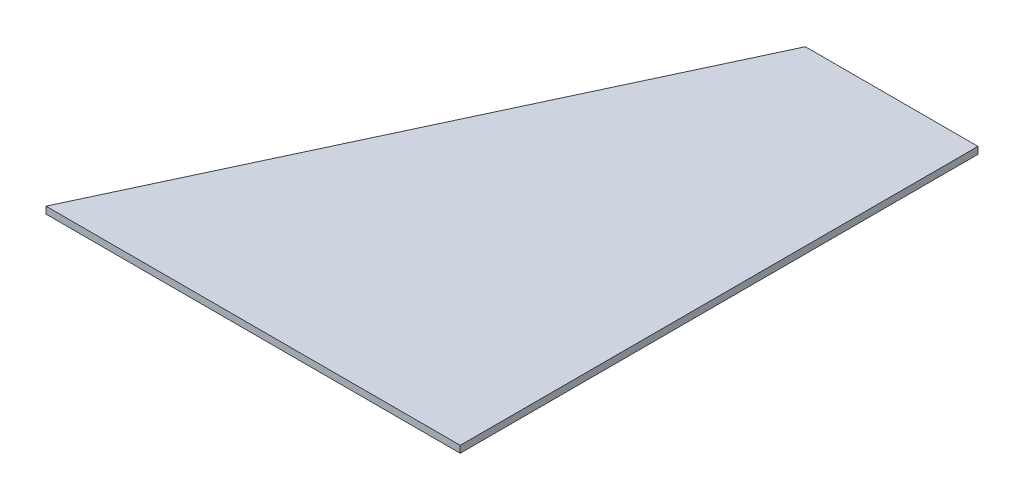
from build123d import *

# Parameters (mm, degrees)
EXTRUDE1_DEPTH = 1


with BuildPart() as part:
    # Sketch1 → Extrude1 (new body)
    with BuildSketch(Plane(origin=(0, 0, 0), x_dir=(1, 0, 0), z_dir=(0, 1, 0))):
        Polygon((0, 0), (60, 0), (60, 75), (35, 75), align=None)
    extrude(amount=EXTRUDE1_DEPTH)


solid = part.part
